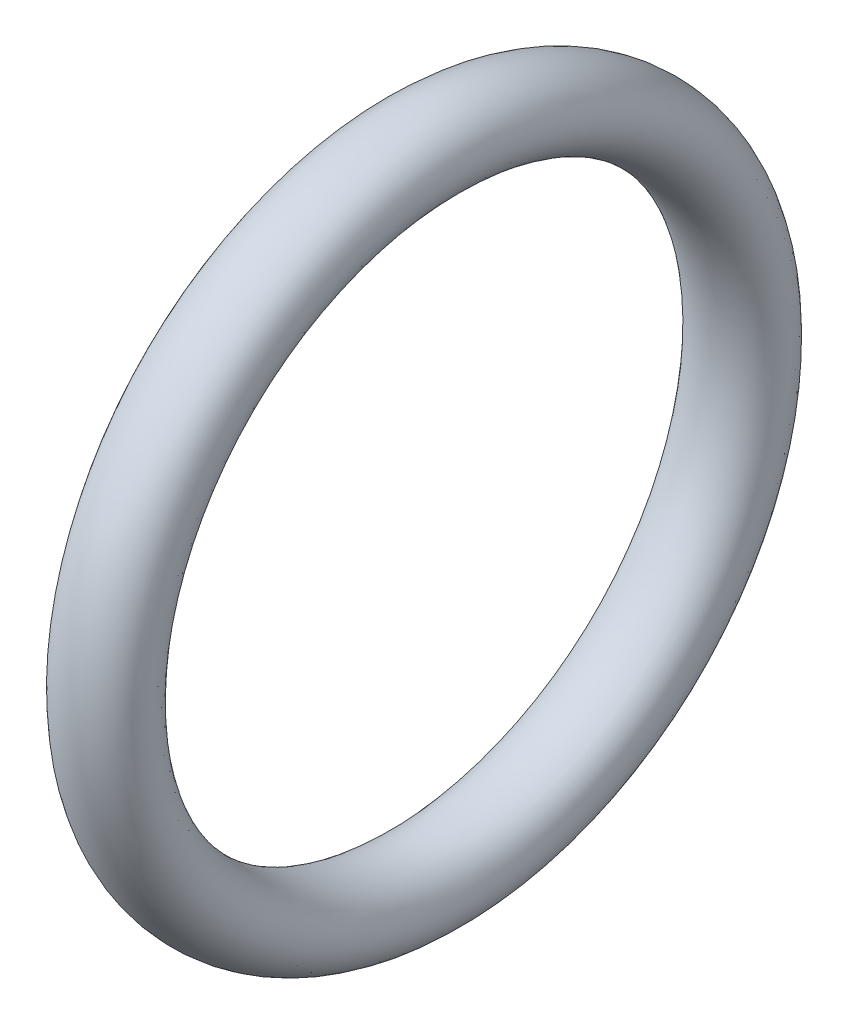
ISO-10303-21;
HEADER;
FILE_DESCRIPTION(('STEP AP214'),'2;1');
FILE_NAME('part.step','',(''),(''),'','','');
FILE_SCHEMA(('AUTOMOTIVE_DESIGN { 1 0 10303 214 1 1 1 1 }'));
ENDSEC;
DATA;
#1=APPLICATION_CONTEXT('core data for automotive mechanical design processes');
#2=APPLICATION_PROTOCOL_DEFINITION('international standard','automotive_design',2000,#1);
#3=PRODUCT_CONTEXT('',#1,'mechanical');
#4=PRODUCT('Part','Part','',(#3));
#5=PRODUCT_RELATED_PRODUCT_CATEGORY('part','',(#4));
#6=PRODUCT_DEFINITION_FORMATION('','',#4);
#7=PRODUCT_DEFINITION_CONTEXT('part definition',#1,'design');
#8=PRODUCT_DEFINITION('design','',#6,#7);
#9=PRODUCT_DEFINITION_SHAPE('','',#8);
#10=(LENGTH_UNIT() NAMED_UNIT(*) SI_UNIT(.MILLI.,.METRE.));
#11=(NAMED_UNIT(*) PLANE_ANGLE_UNIT() SI_UNIT($,.RADIAN.));
#12=(NAMED_UNIT(*) SI_UNIT($,.STERADIAN.) SOLID_ANGLE_UNIT());
#13=UNCERTAINTY_MEASURE_WITH_UNIT(LENGTH_MEASURE(1.E-05),#10,'distance_accuracy_value','');
#14=(GEOMETRIC_REPRESENTATION_CONTEXT(3) GLOBAL_UNCERTAINTY_ASSIGNED_CONTEXT((#13)) GLOBAL_UNIT_ASSIGNED_CONTEXT((#10,
#11,#12)) REPRESENTATION_CONTEXT('',''));
#15=CARTESIAN_POINT('',(0.,0.,0.));
#16=DIRECTION('',(0.,0.,1.));
#17=DIRECTION('',(1.,0.,0.));
#18=AXIS2_PLACEMENT_3D('',#15,#16,#17);
#19=CARTESIAN_POINT('',(0.,13.4874,0.));
#20=DIRECTION('',(0.,0.,1.));
#21=DIRECTION('',(-1.,0.,0.));
#22=AXIS2_PLACEMENT_3D('',#19,#20,#21);
#23=ELLIPSE('',#22,1.94743412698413,1.6002);
#24=CARTESIAN_POINT('',(-14.9542424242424,0.,0.));
#25=DIRECTION('',(-1.,0.,0.));
#26=AXIS1_PLACEMENT('',#24,#25);
#27=SURFACE_OF_REVOLUTION('',#23,#26);
#28=ADVANCED_FACE('F27',(),#27,.T.);
#29=CLOSED_SHELL('',(#28));
#30=MANIFOLD_SOLID_BREP('B2',#29);
#31=ADVANCED_BREP_SHAPE_REPRESENTATION('',(#18,#30),#14);
#32=SHAPE_DEFINITION_REPRESENTATION(#9,#31);
ENDSEC;
END-ISO-10303-21;
